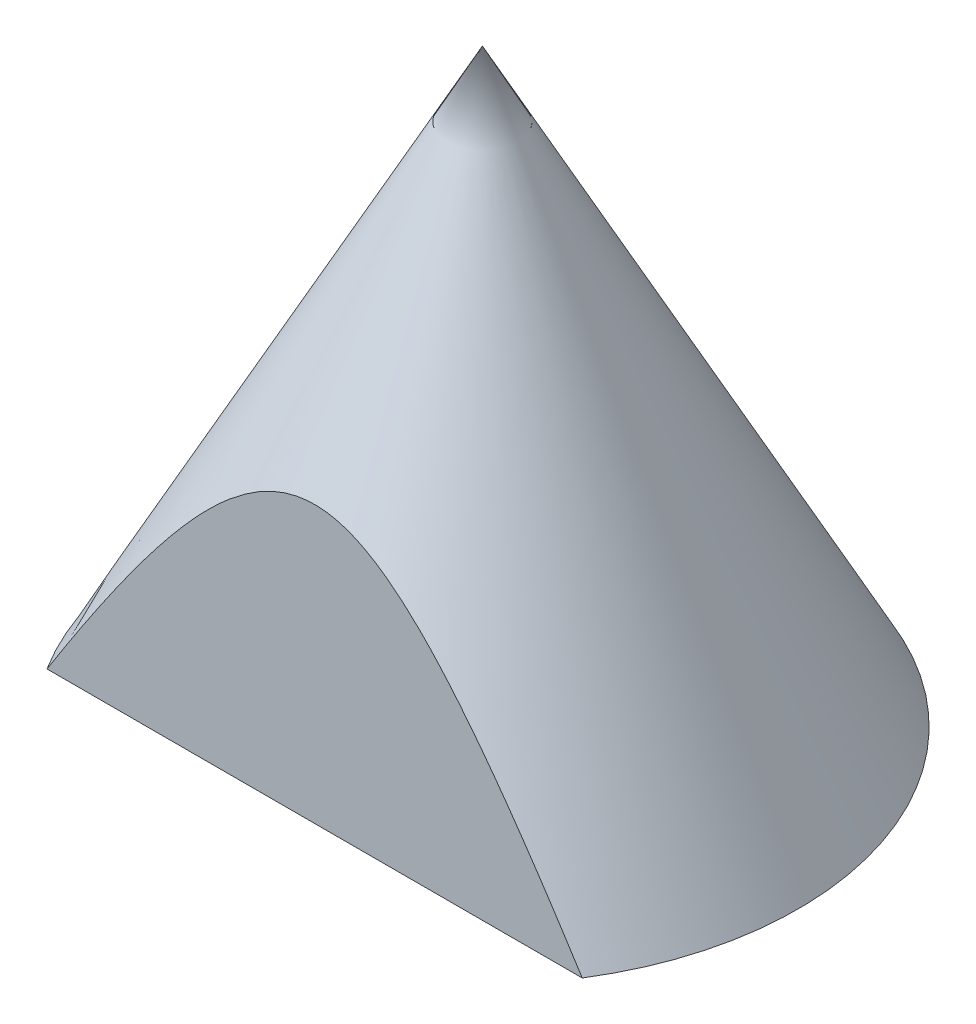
from build123d import *

# Parameters (mm, degrees)
CUT_EXTRUDE_2_DEPTH = 30


with BuildPart() as part:
    # Sketch 1 → Revolve 1 (revolve)
    with BuildSketch(Plane.XY, mode=Mode.PRIVATE) as revolve_1_sk:
        Polygon((0, 59.840233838), (-30.400090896, 3.118225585), (0, 3.118225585), align=None)
    revolve(revolve_1_sk.sketch.rotate(Axis((0, -13.512310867, 0), (0, 1, 0)), 270), axis=Axis((0, -13.512310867, 0), (0, 1, 0)))

    # Sketch 2 → Cut-Extrude 2 (cut, symmetric)
    with BuildSketch(Plane(origin=(0, 0, 0), x_dir=(0, 0, -1), z_dir=(1, 0, 0))):
        Polygon((-16.148151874, 29.710205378), (-16.148151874, 3.118225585), (-33.01125145, 3.118225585), align=None)
    extrude(amount=CUT_EXTRUDE_2_DEPTH, both=True, mode=Mode.SUBTRACT)


solid = part.part
